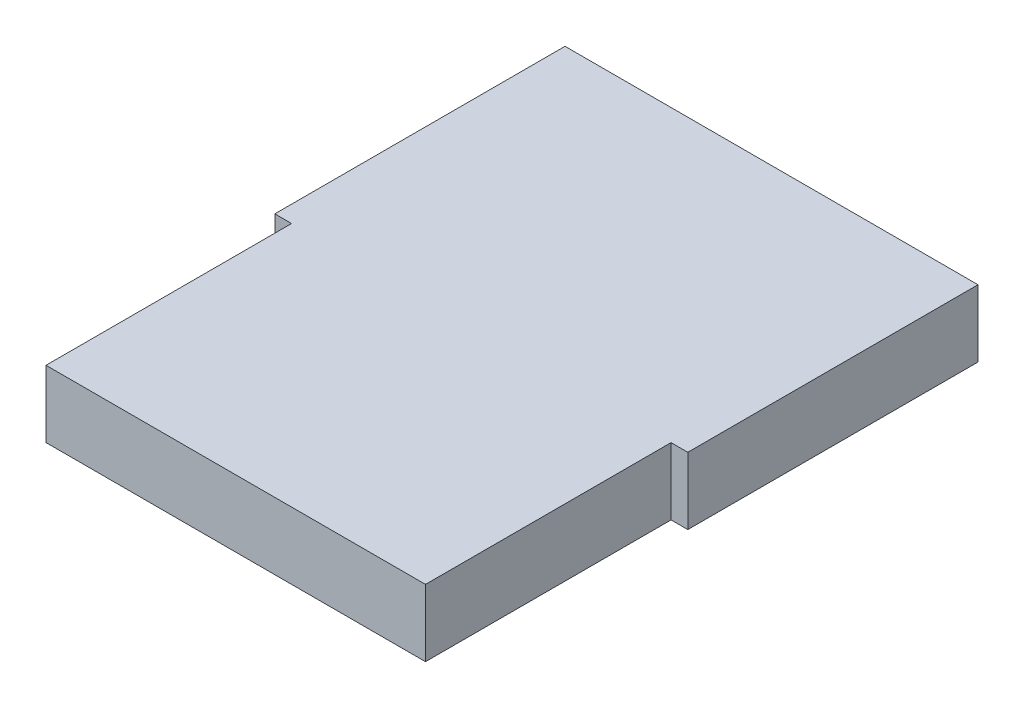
from build123d import *

# Parameters (mm, degrees)
SKETCH1_R           = 5.85
BOSS_EXTRUDE1_DEPTH = 4
SKETCH2_W           = 37
SKETCH2_H           = 6
BOSS_EXTRUDE2_DEPTH = 48
SKETCH3_W           = 1.5
SKETCH3_H           = 22
CUT_EXTRUDE1_DEPTH  = 10
SKETCH4_W           = 39.000896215
SKETCH4_H           = 39.256286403
CUT_EXTRUDE2_DEPTH  = 10


with BuildPart() as part:
    # Sketch1 → Boss-Extrude1 (new body)
    with BuildSketch(Plane.XY):
        with BuildLine():
            Line((-46.110395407, -22.5), (-9.110395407, -22.5))
            Line((-9.110395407, -22.5), (-9.110395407, 0))
            ThreePointArc((-9.110395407, 0), (-27.610395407, 18.5), (-46.110395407, 0))
            Line((-46.110395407, 0), (-46.110395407, -22.5))
        make_face()
        with Locations((-27.610395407, 6.85)):
            Circle(SKETCH1_R, mode=Mode.SUBTRACT)
    extrude(amount=BOSS_EXTRUDE1_DEPTH)

    # Sketch2 → Boss-Extrude2 (add)
    with BuildSketch(Plane.XY):
        with Locations((-27.610395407, -19.5)):
            Rectangle(SKETCH2_W, SKETCH2_H)
    extrude(amount=BOSS_EXTRUDE2_DEPTH)

    # Sketch3 → Cut-Extrude1 (cut)
    with BuildSketch(Plane(origin=(0, -16.5, 0), x_dir=(1, 0, 0), z_dir=(0, 1, 0))):
        with Locations((-9.860395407, -37)):
            Rectangle(SKETCH3_W, SKETCH3_H)
        with Locations((-45.360395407, -37)):
            Rectangle(SKETCH3_W, SKETCH3_H)
    extrude(amount=-CUT_EXTRUDE1_DEPTH, mode=Mode.SUBTRACT)

    # Sketch4 → Cut-Extrude2 (cut)
    with BuildSketch(Plane.XY.offset(4)):
        with Locations((-28.610843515, 3.128143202)):
            Rectangle(SKETCH4_W, SKETCH4_H)
    extrude(amount=-CUT_EXTRUDE2_DEPTH, mode=Mode.SUBTRACT)


solid = part.part
